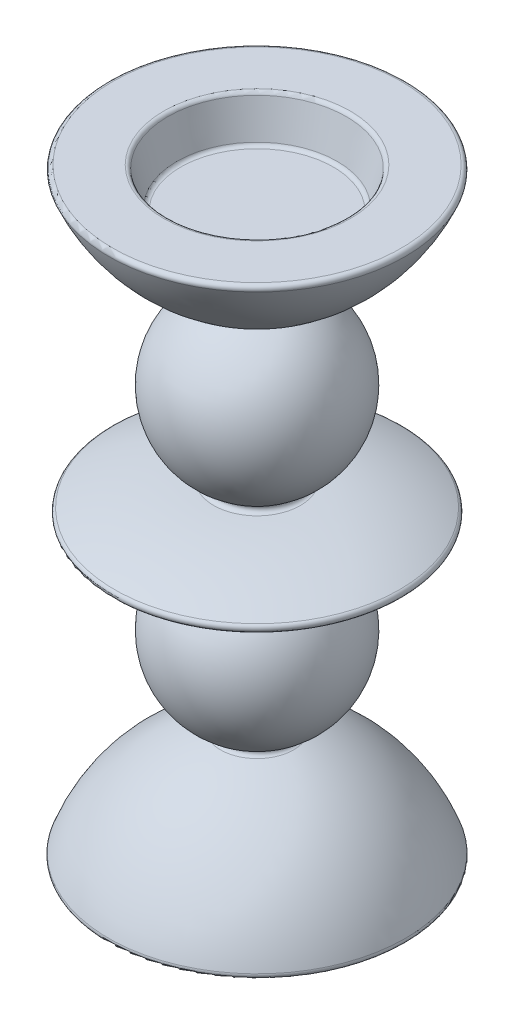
ISO-10303-21;
HEADER;
FILE_DESCRIPTION(('STEP AP214'),'2;1');
FILE_NAME('part.step','',(''),(''),'','','');
FILE_SCHEMA(('AUTOMOTIVE_DESIGN { 1 0 10303 214 1 1 1 1 }'));
ENDSEC;
DATA;
#1=APPLICATION_CONTEXT('core data for automotive mechanical design processes');
#2=APPLICATION_PROTOCOL_DEFINITION('international standard','automotive_design',2000,#1);
#3=PRODUCT_CONTEXT('',#1,'mechanical');
#4=PRODUCT('Part','Part','',(#3));
#5=PRODUCT_RELATED_PRODUCT_CATEGORY('part','',(#4));
#6=PRODUCT_DEFINITION_FORMATION('','',#4);
#7=PRODUCT_DEFINITION_CONTEXT('part definition',#1,'design');
#8=PRODUCT_DEFINITION('design','',#6,#7);
#9=PRODUCT_DEFINITION_SHAPE('','',#8);
#10=(LENGTH_UNIT() NAMED_UNIT(*) SI_UNIT(.MILLI.,.METRE.));
#11=(NAMED_UNIT(*) PLANE_ANGLE_UNIT() SI_UNIT($,.RADIAN.));
#12=(NAMED_UNIT(*) SI_UNIT($,.STERADIAN.) SOLID_ANGLE_UNIT());
#13=UNCERTAINTY_MEASURE_WITH_UNIT(LENGTH_MEASURE(1.E-05),#10,'distance_accuracy_value','');
#14=(GEOMETRIC_REPRESENTATION_CONTEXT(3) GLOBAL_UNCERTAINTY_ASSIGNED_CONTEXT((#13)) GLOBAL_UNIT_ASSIGNED_CONTEXT((#10,
#11,#12)) REPRESENTATION_CONTEXT('',''));
#15=CARTESIAN_POINT('',(0.,0.,0.));
#16=DIRECTION('',(0.,0.,1.));
#17=DIRECTION('',(1.,0.,0.));
#18=AXIS2_PLACEMENT_3D('',#15,#16,#17);
#19=CARTESIAN_POINT('',(0.,150.,0.));
#20=DIRECTION('',(0.,1.,0.));
#21=DIRECTION('',(-1.,0.,0.));
#22=AXIS2_PLACEMENT_3D('',#19,#20,#21);
#23=PLANE('',#22);
#24=CARTESIAN_POINT('',(0.,150.,0.));
#25=DIRECTION('',(0.,1.,0.));
#26=DIRECTION('',(-1.,0.,0.));
#27=AXIS2_PLACEMENT_3D('',#24,#25,#26);
#28=CIRCLE('',#27,36.0147368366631);
#29=CARTESIAN_POINT('',(-36.0147368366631,150.,0.));
#30=VERTEX_POINT('',#29);
#31=EDGE_CURVE('E62',#30,#30,#28,.T.);
#32=ORIENTED_EDGE('',*,*,#31,.T.);
#33=EDGE_LOOP('',(#32));
#34=FACE_BOUND('',#33,.T.);
#35=CARTESIAN_POINT('',(0.,150.,0.));
#36=DIRECTION('',(0.,1.,0.));
#37=DIRECTION('',(-1.,0.,0.));
#38=AXIS2_PLACEMENT_3D('',#35,#36,#37);
#39=CIRCLE('',#38,23.267326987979);
#40=CARTESIAN_POINT('',(-23.267326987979,150.,0.));
#41=VERTEX_POINT('',#40);
#42=EDGE_CURVE('E65',#41,#41,#39,.F.);
#43=ORIENTED_EDGE('',*,*,#42,.T.);
#44=EDGE_LOOP('',(#43));
#45=FACE_BOUND('',#44,.T.);
#46=ADVANCED_FACE('F30',(#34,#45),#23,.T.);
#47=CARTESIAN_POINT('',(4.81553578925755,23.1036435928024,0.));
#48=DIRECTION('',(0.,-1.,0.));
#49=DIRECTION('',(1.,0.,0.));
#50=AXIS2_PLACEMENT_3D('',#47,#48,#49);
#51=PLANE('',#50);
#52=CARTESIAN_POINT('',(0.,23.1036435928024,0.));
#53=DIRECTION('',(0.,-1.,0.));
#54=DIRECTION('',(1.,0.,0.));
#55=AXIS2_PLACEMENT_3D('',#52,#53,#54);
#56=CIRCLE('',#55,4.81553578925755);
#57=CARTESIAN_POINT('',(4.81553578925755,23.1036435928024,0.));
#58=VERTEX_POINT('',#57);
#59=EDGE_CURVE('E98',#58,#58,#56,.T.);
#60=ORIENTED_EDGE('',*,*,#59,.T.);
#61=EDGE_LOOP('',(#60));
#62=FACE_BOUND('',#61,.T.);
#63=ADVANCED_FACE('F102',(#62),#51,.T.);
#64=CARTESIAN_POINT('',(0.,-13.7910629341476,0.));
#65=DIRECTION('',(0.,-1.,0.));
#66=DIRECTION('',(1.,0.,0.));
#67=AXIS2_PLACEMENT_3D('',#64,#65,#66);
#68=DEGENERATE_TOROIDAL_SURFACE('',#67,4.28285034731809,38.,.F.);
#69=CARTESIAN_POINT('',(0.,0.620741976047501,0.));
#70=DIRECTION('',(0.,-1.,0.));
#71=DIRECTION('',(1.,0.,0.));
#72=AXIS2_PLACEMENT_3D('',#69,#70,#71);
#73=CIRCLE('',#72,30.8782059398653);
#74=CARTESIAN_POINT('',(30.8782059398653,0.620741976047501,0.));
#75=VERTEX_POINT('',#74);
#76=EDGE_CURVE('E95',#75,#75,#73,.T.);
#77=ORIENTED_EDGE('',*,*,#76,.T.);
#78=EDGE_LOOP('',(#77));
#79=FACE_BOUND('',#78,.T.);
#80=ORIENTED_EDGE('',*,*,#59,.F.);
#81=EDGE_LOOP('',(#80));
#82=FACE_BOUND('',#81,.T.);
#83=ADVANCED_FACE('F104',(#79,#82),#68,.T.);
#84=CARTESIAN_POINT('',(37.5,0.,0.));
#85=DIRECTION('',(0.,-1.,0.));
#86=DIRECTION('',(1.,0.,0.));
#87=AXIS2_PLACEMENT_3D('',#84,#85,#86);
#88=PLANE('',#87);
#89=CARTESIAN_POINT('',(0.,0.,0.));
#90=DIRECTION('',(0.,-1.,0.));
#91=DIRECTION('',(1.,0.,0.));
#92=AXIS2_PLACEMENT_3D('',#89,#90,#91);
#93=CIRCLE('',#92,31.8034968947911);
#94=CARTESIAN_POINT('',(31.8034968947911,0.,0.));
#95=VERTEX_POINT('',#94);
#96=EDGE_CURVE('E89',#95,#95,#93,.F.);
#97=ORIENTED_EDGE('',*,*,#96,.T.);
#98=EDGE_LOOP('',(#97));
#99=FACE_BOUND('',#98,.T.);
#100=CARTESIAN_POINT('',(0.,0.,0.));
#101=DIRECTION('',(0.,-1.,0.));
#102=DIRECTION('',(1.,0.,0.));
#103=AXIS2_PLACEMENT_3D('',#100,#101,#102);
#104=CIRCLE('',#103,36.0931878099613);
#105=CARTESIAN_POINT('',(36.0931878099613,0.,0.));
#106=VERTEX_POINT('',#105);
#107=EDGE_CURVE('E92',#106,#106,#104,.T.);
#108=ORIENTED_EDGE('',*,*,#107,.T.);
#109=EDGE_LOOP('',(#108));
#110=FACE_BOUND('',#109,.T.);
#111=ADVANCED_FACE('F106',(#99,#110),#88,.T.);
#112=CARTESIAN_POINT('',(0.,-13.7910629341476,0.));
#113=DIRECTION('',(0.,-1.,0.));
#114=DIRECTION('',(1.,0.,0.));
#115=AXIS2_PLACEMENT_3D('',#112,#113,#114);
#116=DEGENERATE_TOROIDAL_SURFACE('',#115,4.28285034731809,44.,.F.);
#117=CARTESIAN_POINT('',(0.,1.34397820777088,0.));
#118=DIRECTION('',(0.,-1.,0.));
#119=DIRECTION('',(1.,0.,0.));
#120=AXIS2_PLACEMENT_3D('',#117,#118,#119);
#121=CIRCLE('',#120,37.032165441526);
#122=CARTESIAN_POINT('',(37.032165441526,1.34397820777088,0.));
#123=VERTEX_POINT('',#122);
#124=EDGE_CURVE('E83',#123,#123,#121,.F.);
#125=ORIENTED_EDGE('',*,*,#124,.T.);
#126=EDGE_LOOP('',(#125));
#127=FACE_BOUND('',#126,.T.);
#128=CARTESIAN_POINT('',(0.,28.1173566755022,0.));
#129=DIRECTION('',(0.,-1.,0.));
#130=DIRECTION('',(1.,0.,0.));
#131=AXIS2_PLACEMENT_3D('',#128,#129,#130);
#132=CIRCLE('',#131,9.12178936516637);
#133=CARTESIAN_POINT('',(9.12178936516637,28.1173566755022,0.));
#134=VERTEX_POINT('',#133);
#135=EDGE_CURVE('E86',#134,#134,#132,.T.);
#136=ORIENTED_EDGE('',*,*,#135,.T.);
#137=EDGE_LOOP('',(#136));
#138=FACE_BOUND('',#137,.T.);
#139=ADVANCED_FACE('F113',(#127,#138),#116,.F.);
#140=CARTESIAN_POINT('',(0.,49.5,0.));
#141=DIRECTION('',(0.,-1.,0.));
#142=DIRECTION('',(1.,0.,0.));
#143=AXIS2_PLACEMENT_3D('',#140,#141,#142);
#144=SPHERICAL_SURFACE('',#143,21.5);
#145=CARTESIAN_POINT('',(0.,29.9778287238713,0.));
#146=DIRECTION('',(0.,1.,0.));
#147=DIRECTION('',(-1.,0.,0.));
#148=AXIS2_PLACEMENT_3D('',#145,#146,#147);
#149=CIRCLE('',#148,9.00748736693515);
#150=CARTESIAN_POINT('',(9.00748736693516,29.9778287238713,0.));
#151=VERTEX_POINT('',#150);
#152=EDGE_CURVE('E41',#151,#151,#149,.T.);
#153=CARTESIAN_POINT('',(0.,67.7942402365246,0.));
#154=DIRECTION('',(0.,-1.,0.));
#155=DIRECTION('',(1.,0.,0.));
#156=AXIS2_PLACEMENT_3D('',#153,#154,#155);
#157=CIRCLE('',#156,11.2947232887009);
#158=CARTESIAN_POINT('',(11.2947232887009,67.7942402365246,0.));
#159=VERTEX_POINT('',#158);
#160=EDGE_CURVE('E45',#159,#159,#157,.T.);
#161=CARTESIAN_POINT('',(9.00748736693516,29.9778287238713,0.));
#162=CARTESIAN_POINT('',(9.22672523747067,30.078982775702,0.));
#163=CARTESIAN_POINT('',(9.44425766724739,30.1838328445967,0.));
#164=CARTESIAN_POINT('',(9.87566802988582,30.4007995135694,0.));
#165=CARTESIAN_POINT('',(10.0895459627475,30.5129161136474,0.));
#166=CARTESIAN_POINT('',(10.5134037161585,30.7442903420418,0.));
#167=CARTESIAN_POINT('',(10.7233835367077,30.8635479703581,0.));
#168=CARTESIAN_POINT('',(11.1392069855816,31.1090684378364,0.));
#169=CARTESIAN_POINT('',(11.3450506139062,31.2353312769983,0.));
#170=CARTESIAN_POINT('',(11.7523679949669,31.4947189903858,0.));
#171=CARTESIAN_POINT('',(11.953841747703,31.6278438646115,0.));
#172=CARTESIAN_POINT('',(12.3521907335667,31.9008045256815,0.));
#173=CARTESIAN_POINT('',(12.5490659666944,32.0406403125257,0.));
#174=CARTESIAN_POINT('',(12.9379944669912,32.3268641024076,0.));
#175=CARTESIAN_POINT('',(13.1300477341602,32.4732521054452,0.));
#176=CARTESIAN_POINT('',(13.5091143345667,32.772414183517,0.));
#177=CARTESIAN_POINT('',(13.6961276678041,32.9251882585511,0.));
#178=CARTESIAN_POINT('',(14.0649021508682,33.2369490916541,0.));
#179=CARTESIAN_POINT('',(14.2466633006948,33.3959358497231,0.));
#180=CARTESIAN_POINT('',(14.6047271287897,33.7199416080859,0.));
#181=CARTESIAN_POINT('',(14.7810298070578,33.8849606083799,0.));
#182=CARTESIAN_POINT('',(15.1279765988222,34.2208435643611,0.));
#183=CARTESIAN_POINT('',(15.2986207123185,34.3917075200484,0.));
#184=CARTESIAN_POINT('',(15.6340567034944,34.7390864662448,0.));
#185=CARTESIAN_POINT('',(15.798848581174,34.915601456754,0.));
#186=CARTESIAN_POINT('',(16.1223930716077,35.2740821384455,0.));
#187=CARTESIAN_POINT('',(16.2811456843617,35.4560478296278,0.));
#188=CARTESIAN_POINT('',(16.592431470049,35.8252233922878,0.));
#189=CARTESIAN_POINT('',(16.7449646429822,36.0124332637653,0.));
#190=CARTESIAN_POINT('',(17.0436384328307,36.3918847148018,0.));
#191=CARTESIAN_POINT('',(17.189779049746,36.5841262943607,0.));
#192=CARTESIAN_POINT('',(17.4755018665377,36.9734229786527,0.));
#193=CARTESIAN_POINT('',(17.6150840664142,37.1704780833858,0.));
#194=CARTESIAN_POINT('',(17.8875316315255,37.5691781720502,0.));
#195=CARTESIAN_POINT('',(18.0203969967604,37.7708231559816,0.));
#196=CARTESIAN_POINT('',(18.279260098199,38.1784741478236,0.));
#197=CARTESIAN_POINT('',(18.4052578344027,38.3844801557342,0.));
#198=CARTESIAN_POINT('',(18.6502426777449,38.8006193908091,0.));
#199=CARTESIAN_POINT('',(18.7692297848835,39.0107526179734,0.));
#200=CARTESIAN_POINT('',(19.000058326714,39.4349078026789,0.));
#201=CARTESIAN_POINT('',(19.111899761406,39.64892976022,0.));
#202=CARTESIAN_POINT('',(19.3283100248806,40.0806195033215,0.));
#203=CARTESIAN_POINT('',(19.4328788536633,40.2982872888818,0.));
#204=CARTESIAN_POINT('',(19.6346252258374,40.7370216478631,0.));
#205=CARTESIAN_POINT('',(19.7318027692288,40.9580882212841,0.));
#206=CARTESIAN_POINT('',(19.9186562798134,41.4033692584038,0.));
#207=CARTESIAN_POINT('',(20.0083322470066,41.6275837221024,0.));
#208=CARTESIAN_POINT('',(20.1800808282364,42.0789060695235,0.));
#209=CARTESIAN_POINT('',(20.262153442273,42.306013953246,0.));
#210=CARTESIAN_POINT('',(20.4186021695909,42.762865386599,0.));
#211=CARTESIAN_POINT('',(20.4929782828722,42.9926089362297,0.));
#212=CARTESIAN_POINT('',(20.633949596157,43.4544709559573,0.));
#213=CARTESIAN_POINT('',(20.7005447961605,43.6865894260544,0.));
#214=CARTESIAN_POINT('',(20.8258787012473,44.1529378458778,0.));
#215=CARTESIAN_POINT('',(20.8846174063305,44.3871677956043,0.));
#216=CARTESIAN_POINT('',(20.9941716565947,44.857473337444,0.));
#217=CARTESIAN_POINT('',(21.0449872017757,45.0935489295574,0.));
#218=CARTESIAN_POINT('',(21.1386374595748,45.5672778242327,0.));
#219=CARTESIAN_POINT('',(21.1814721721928,45.8049311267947,0.));
#220=CARTESIAN_POINT('',(21.2591121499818,46.2815457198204,0.));
#221=CARTESIAN_POINT('',(21.2939174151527,46.5205070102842,0.));
#222=CARTESIAN_POINT('',(21.3554589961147,46.9994663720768,0.));
#223=CARTESIAN_POINT('',(21.3821953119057,47.2394644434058,0.));
#224=CARTESIAN_POINT('',(21.4275686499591,47.7202249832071,0.));
#225=CARTESIAN_POINT('',(21.4462056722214,47.9609874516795,0.));
#226=CARTESIAN_POINT('',(21.4753592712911,48.4430035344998,0.));
#227=CARTESIAN_POINT('',(21.4858758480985,48.6842571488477,0.));
#228=CARTESIAN_POINT('',(21.4987766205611,49.1669817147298,0.));
#229=CARTESIAN_POINT('',(21.5011608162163,49.4084526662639,0.));
#230=CARTESIAN_POINT('',(21.4977941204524,49.8913378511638,0.));
#231=CARTESIAN_POINT('',(21.4920432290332,50.1327520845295,0.));
#232=CARTESIAN_POINT('',(21.4724128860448,50.6152498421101,0.));
#233=CARTESIAN_POINT('',(21.4585334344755,50.8563333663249,0.));
#234=CARTESIAN_POINT('',(21.4226617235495,51.3378960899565,0.));
#235=CARTESIAN_POINT('',(21.4006694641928,51.5783752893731,0.));
#236=CARTESIAN_POINT('',(21.3485970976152,52.0584564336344,0.));
#237=CARTESIAN_POINT('',(21.3185169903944,52.2980583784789,0.));
#238=CARTESIAN_POINT('',(21.2503030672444,52.7761130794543,0.));
#239=CARTESIAN_POINT('',(21.2121692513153,53.0145658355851,0.));
#240=CARTESIAN_POINT('',(21.1278911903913,53.4900515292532,0.));
#241=CARTESIAN_POINT('',(21.0817469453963,53.7270844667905,0.));
#242=CARTESIAN_POINT('',(20.9815003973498,54.1994615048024,0.));
#243=CARTESIAN_POINT('',(20.9273980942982,54.434805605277,0.));
#244=CARTESIAN_POINT('',(20.8112968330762,54.9035378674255,0.));
#245=CARTESIAN_POINT('',(20.7492978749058,55.1369260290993,0.));
#246=CARTESIAN_POINT('',(20.6174736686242,55.6014815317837,0.));
#247=CARTESIAN_POINT('',(20.5476484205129,55.8326488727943,0.));
#248=CARTESIAN_POINT('',(20.400250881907,56.2925003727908,0.));
#249=CARTESIAN_POINT('',(20.3226785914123,56.5211845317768,0.));
#250=CARTESIAN_POINT('',(20.1598750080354,56.9758101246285,0.));
#251=CARTESIAN_POINT('',(20.0746437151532,57.2017515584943,0.));
#252=CARTESIAN_POINT('',(19.8966188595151,57.6506352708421,0.));
#253=CARTESIAN_POINT('',(19.8038252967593,57.8735775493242,0.));
#254=CARTESIAN_POINT('',(19.6107812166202,58.3162099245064,0.));
#255=CARTESIAN_POINT('',(19.510530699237,58.5359000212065,0.));
#256=CARTESIAN_POINT('',(19.3026864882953,58.9717786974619,0.));
#257=CARTESIAN_POINT('',(19.1950927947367,59.1879672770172,0.));
#258=CARTESIAN_POINT('',(18.9726843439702,59.6165975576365,0.));
#259=CARTESIAN_POINT('',(18.8578695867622,59.8290392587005,0.));
#260=CARTESIAN_POINT('',(18.6211493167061,60.249934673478,0.));
#261=CARTESIAN_POINT('',(18.499243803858,60.4583883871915,0.));
#262=CARTESIAN_POINT('',(18.248480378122,60.8710712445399,0.));
#263=CARTESIAN_POINT('',(18.1196224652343,61.075300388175,0.));
#264=CARTESIAN_POINT('',(17.8551004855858,61.4793023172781,0.));
#265=CARTESIAN_POINT('',(17.7194364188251,61.6790751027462,0.));
#266=CARTESIAN_POINT('',(17.4414561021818,62.0739375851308,0.));
#267=CARTESIAN_POINT('',(17.2991398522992,62.2690272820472,0.));
#268=CARTESIAN_POINT('',(17.0080166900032,62.6543021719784,0.));
#269=CARTESIAN_POINT('',(16.8592097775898,62.8444873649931,0.));
#270=CARTESIAN_POINT('',(16.5552741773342,63.2197373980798,0.));
#271=CARTESIAN_POINT('',(16.4001454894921,63.4048022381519,0.));
#272=CARTESIAN_POINT('',(16.0837424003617,63.7696015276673,0.));
#273=CARTESIAN_POINT('',(15.9224679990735,63.9493359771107,0.));
#274=CARTESIAN_POINT('',(15.5939565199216,64.3032704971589,0.));
#275=CARTESIAN_POINT('',(15.426719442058,64.4774705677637,0.));
#276=CARTESIAN_POINT('',(15.0864724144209,64.8201386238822,0.));
#277=CARTESIAN_POINT('',(14.9134624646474,64.9886066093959,0.));
#278=CARTESIAN_POINT('',(14.561866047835,65.3196192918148,0.));
#279=CARTESIAN_POINT('',(14.3832795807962,65.48216398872,0.));
#280=CARTESIAN_POINT('',(14.0207328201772,65.8011456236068,0.));
#281=CARTESIAN_POINT('',(13.8367725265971,65.9575825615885,0.));
#282=CARTESIAN_POINT('',(13.4636868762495,66.264171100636,0.));
#283=CARTESIAN_POINT('',(13.2745615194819,66.4143227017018,0.));
#284=CARTESIAN_POINT('',(12.8913604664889,66.7081702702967,0.));
#285=CARTESIAN_POINT('',(12.6972847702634,66.8518662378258,0.));
#286=CARTESIAN_POINT('',(12.304403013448,67.1326390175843,0.));
#287=CARTESIAN_POINT('',(12.1055969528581,67.2697158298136,0.));
#288=CARTESIAN_POINT('',(11.7034811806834,67.5370963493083,0.));
#289=CARTESIAN_POINT('',(11.5001714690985,67.6674000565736,0.));
#290=CARTESIAN_POINT('',(11.2947232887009,67.7942402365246,0.));
#291=B_SPLINE_CURVE_WITH_KNOTS('',3,(#161,#162,#163,#164,#165,#166,#167,#168,#169,#170,#171,
#172,#173,#174,#175,#176,#177,#178,#179,#180,#181,#182,#183,#184,#185,#186,#187,#188,#189,#190,
#191,#192,#193,#194,#195,#196,#197,#198,#199,#200,#201,#202,#203,#204,#205,#206,#207,#208,#209,
#210,#211,#212,#213,#214,#215,#216,#217,#218,#219,#220,#221,#222,#223,#224,#225,#226,#227,#228,
#229,#230,#231,#232,#233,#234,#235,#236,#237,#238,#239,#240,#241,#242,#243,#244,#245,#246,#247,
#248,#249,#250,#251,#252,#253,#254,#255,#256,#257,#258,#259,#260,#261,#262,#263,#264,#265,#266,
#267,#268,#269,#270,#271,#272,#273,#274,#275,#276,#277,#278,#279,#280,#281,#282,#283,#284,#285,
#286,#287,#288,#289,#290),.UNSPECIFIED.,.F.,.F.,(4,2,2,2,2,2,2,2,2,2,2,2,2,2,2,2,2,2,2,2,2,2,2,
2,2,2,2,2,2,2,2,2,2,2,2,2,2,2,2,2,2,2,2,2,2,2,2,2,2,2,2,2,2,2,2,2,2,2,2,2,2,2,2,2,4),(0.,
0.724311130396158,1.44862226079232,2.17293339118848,2.89724452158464,3.62155565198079,
4.34586678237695,5.0701779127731,5.79448904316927,6.51880017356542,7.24311130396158,
7.96742243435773,8.69173356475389,9.41604469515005,10.1403558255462,10.8646669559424,
11.5889780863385,12.3132892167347,13.0376003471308,13.761911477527,14.4862226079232,
15.2105337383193,15.9348448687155,16.6591559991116,17.3834671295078,18.1077782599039,
18.8320893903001,19.5564005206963,20.2807116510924,21.0050227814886,21.7293339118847,
22.4536450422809,23.177956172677,23.9022673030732,24.6265784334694,25.3508895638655,
26.0752006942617,26.7995118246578,27.523822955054,28.2481340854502,28.9724452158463,
29.6967563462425,30.4210674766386,31.1453786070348,31.8696897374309,32.5940008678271,
33.3183119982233,34.0426231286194,34.7669342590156,35.4912453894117,36.2155565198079,
36.9398676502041,37.6641787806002,38.3884899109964,39.1128010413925,39.8371121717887,
40.5614233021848,41.285734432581,42.0100455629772,42.7343566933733,43.4586678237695,
44.1829789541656,44.9072900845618,45.6316012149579,46.3559123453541),.UNSPECIFIED.);
#292=EDGE_CURVE('BSEAM178',#151,#159,#291,.T.);
#293=ORIENTED_EDGE('',*,*,#152,.T.);
#294=ORIENTED_EDGE('',*,*,#160,.T.);
#295=ORIENTED_EDGE('',*,*,#292,.T.);
#296=ORIENTED_EDGE('',*,*,#292,.F.);
#297=EDGE_LOOP('',(#293,#295,#294,#296));
#298=FACE_BOUND('',#297,.T.);
#299=ADVANCED_FACE('F178',(#298),#144,.T.);
#300=CARTESIAN_POINT('',(0.,129.638664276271,0.));
#301=DIRECTION('',(0.,-1.,0.));
#302=DIRECTION('',(1.,0.,0.));
#303=AXIS2_PLACEMENT_3D('',#300,#301,#302);
#304=DEGENERATE_TOROIDAL_SURFACE('',#303,12.7085424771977,60.,.T.);
#305=CARTESIAN_POINT('',(0.,74.1398819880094,0.));
#306=DIRECTION('',(0.,1.,0.));
#307=DIRECTION('',(-1.,0.,0.));
#308=AXIS2_PLACEMENT_3D('',#305,#306,#307);
#309=CIRCLE('',#308,35.5095329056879);
#310=CARTESIAN_POINT('',(-35.5095329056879,74.1398819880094,0.));
#311=VERTEX_POINT('',#310);
#312=EDGE_CURVE('E56',#311,#311,#309,.F.);
#313=ORIENTED_EDGE('',*,*,#312,.T.);
#314=EDGE_LOOP('',(#313));
#315=FACE_BOUND('',#314,.T.);
#316=CARTESIAN_POINT('',(0.,69.6450290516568,0.));
#317=DIRECTION('',(0.,1.,0.));
#318=DIRECTION('',(-1.,0.,0.));
#319=AXIS2_PLACEMENT_3D('',#316,#317,#318);
#320=CIRCLE('',#319,11.8346245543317);
#321=CARTESIAN_POINT('',(-11.8346245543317,69.6450290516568,0.));
#322=VERTEX_POINT('',#321);
#323=EDGE_CURVE('E59',#322,#322,#320,.T.);
#324=ORIENTED_EDGE('',*,*,#323,.T.);
#325=EDGE_LOOP('',(#324));
#326=FACE_BOUND('',#325,.T.);
#327=ADVANCED_FACE('F169',(#315,#326),#304,.T.);
#328=CARTESIAN_POINT('',(0.,21.7987730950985,0.));
#329=DIRECTION('',(0.,-1.,0.));
#330=DIRECTION('',(1.,0.,0.));
#331=AXIS2_PLACEMENT_3D('',#328,#329,#330);
#332=DEGENERATE_TOROIDAL_SURFACE('',#331,9.75780369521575,60.,.T.);
#333=CARTESIAN_POINT('',(0.,75.967676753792,0.));
#334=DIRECTION('',(0.,-1.,0.));
#335=DIRECTION('',(1.,0.,0.));
#336=AXIS2_PLACEMENT_3D('',#333,#334,#335);
#337=CIRCLE('',#336,35.5595454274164);
#338=CARTESIAN_POINT('',(35.5595454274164,75.967676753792,0.));
#339=VERTEX_POINT('',#338);
#340=EDGE_CURVE('E50',#339,#339,#337,.F.);
#341=ORIENTED_EDGE('',*,*,#340,.T.);
#342=EDGE_LOOP('',(#341));
#343=FACE_BOUND('',#342,.T.);
#344=CARTESIAN_POINT('',(0.,81.7891518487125,0.));
#345=DIRECTION('',(0.,-1.,0.));
#346=DIRECTION('',(1.,0.,0.));
#347=AXIS2_PLACEMENT_3D('',#344,#345,#346);
#348=CIRCLE('',#347,10.8322603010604);
#349=CARTESIAN_POINT('',(10.8322603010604,81.7891518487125,0.));
#350=VERTEX_POINT('',#349);
#351=EDGE_CURVE('E53',#350,#350,#348,.T.);
#352=ORIENTED_EDGE('',*,*,#351,.T.);
#353=EDGE_LOOP('',(#352));
#354=FACE_BOUND('',#353,.T.);
#355=ADVANCED_FACE('F166',(#343,#354),#332,.T.);
#356=CARTESIAN_POINT('',(0.,102.5,0.));
#357=DIRECTION('',(0.,-1.,0.));
#358=DIRECTION('',(1.,0.,0.));
#359=AXIS2_PLACEMENT_3D('',#356,#357,#358);
#360=SPHERICAL_SURFACE('',#359,21.5);
#361=CARTESIAN_POINT('',(0.,83.6650363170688,0.));
#362=DIRECTION('',(0.,1.,0.));
#363=DIRECTION('',(-1.,0.,0.));
#364=AXIS2_PLACEMENT_3D('',#361,#362,#363);
#365=CIRCLE('',#364,10.3679382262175);
#366=CARTESIAN_POINT('',(10.3679382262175,83.6650363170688,0.));
#367=VERTEX_POINT('',#366);
#368=EDGE_CURVE('E10',#367,#367,#365,.T.);
#369=CARTESIAN_POINT('',(0.,121.927431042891,0.));
#370=DIRECTION('',(0.,-1.,0.));
#371=DIRECTION('',(1.,0.,0.));
#372=AXIS2_PLACEMENT_3D('',#369,#370,#371);
#373=CIRCLE('',#372,9.21004468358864);
#374=CARTESIAN_POINT('',(9.21004468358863,121.927431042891,0.));
#375=VERTEX_POINT('',#374);
#376=EDGE_CURVE('E37',#375,#375,#373,.T.);
#377=CARTESIAN_POINT('',(10.3679382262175,83.6650363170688,0.));
#378=CARTESIAN_POINT('',(10.5833347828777,83.7836019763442,0.));
#379=CARTESIAN_POINT('',(10.796695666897,83.9058655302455,0.));
#380=CARTESIAN_POINT('',(11.2190989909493,84.1576378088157,0.));
#381=CARTESIAN_POINT('',(11.4281414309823,84.2871465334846,0.));
#382=CARTESIAN_POINT('',(11.8416607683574,84.5532585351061,0.));
#383=CARTESIAN_POINT('',(12.0461376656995,84.6898618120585,0.));
#384=CARTESIAN_POINT('',(12.4502855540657,84.9700016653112,0.));
#385=CARTESIAN_POINT('',(12.6499565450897,85.1135382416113,0.));
#386=CARTESIAN_POINT('',(13.0442575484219,85.4073758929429,0.));
#387=CARTESIAN_POINT('',(13.2388875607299,85.5576769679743,0.));
#388=CARTESIAN_POINT('',(13.6228775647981,85.8648666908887,0.));
#389=CARTESIAN_POINT('',(13.8122375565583,86.0217553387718,0.));
#390=CARTESIAN_POINT('',(14.185464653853,86.3419355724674,0.));
#391=CARTESIAN_POINT('',(14.3693317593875,86.5052271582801,0.));
#392=CARTESIAN_POINT('',(14.7313566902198,86.8380210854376,0.));
#393=CARTESIAN_POINT('',(14.9095145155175,87.0075234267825,0.));
#394=CARTESIAN_POINT('',(15.2599112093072,87.3525393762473,0.));
#395=CARTESIAN_POINT('',(15.4321500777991,87.5280529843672,0.));
#396=CARTESIAN_POINT('',(15.7705061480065,87.884884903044,0.));
#397=CARTESIAN_POINT('',(15.9366233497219,88.0662032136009,0.));
#398=CARTESIAN_POINT('',(16.2625405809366,88.4344311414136,0.));
#399=CARTESIAN_POINT('',(16.4223406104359,88.6213407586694,0.));
#400=CARTESIAN_POINT('',(16.7354354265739,89.0005313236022,0.));
#401=CARTESIAN_POINT('',(16.8887302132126,89.1928122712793,0.));
#402=CARTESIAN_POINT('',(17.1886341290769,89.5825191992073,0.));
#403=CARTESIAN_POINT('',(17.3352432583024,89.7799451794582,0.));
#404=CARTESIAN_POINT('',(17.6216033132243,90.1797098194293,0.));
#405=CARTESIAN_POINT('',(17.7613542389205,90.3820484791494,0.));
#406=CARTESIAN_POINT('',(18.0338334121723,90.7914003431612,0.));
#407=CARTESIAN_POINT('',(18.1665616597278,90.998413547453,0.));
#408=CARTESIAN_POINT('',(18.4248392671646,91.4168708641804,0.));
#409=CARTESIAN_POINT('',(18.5503886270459,91.628314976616,0.));
#410=CARTESIAN_POINT('',(18.7941606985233,92.0553852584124,0.));
#411=CARTESIAN_POINT('',(18.9123834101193,92.2710114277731,0.));
#412=CARTESIAN_POINT('',(19.1413630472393,92.7061920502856,0.));
#413=CARTESIAN_POINT('',(19.2521199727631,92.9257465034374,0.));
#414=CARTESIAN_POINT('',(19.4660376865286,93.368525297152,0.));
#415=CARTESIAN_POINT('',(19.5691984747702,93.5917496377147,0.));
#416=CARTESIAN_POINT('',(19.7678025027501,94.0416054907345,0.));
#417=CARTESIAN_POINT('',(19.8632457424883,94.2682370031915,0.));
#418=CARTESIAN_POINT('',(20.0463023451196,94.7246404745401,0.));
#419=CARTESIAN_POINT('',(20.1339157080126,94.9544124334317,0.));
#420=CARTESIAN_POINT('',(20.3012094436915,95.416826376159,0.));
#421=CARTESIAN_POINT('',(20.3808898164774,95.6494683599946,0.));
#422=CARTESIAN_POINT('',(20.5322237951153,96.1173485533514,0.));
#423=CARTESIAN_POINT('',(20.6038774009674,96.3525867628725,0.));
#424=CARTESIAN_POINT('',(20.7390735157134,96.825382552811,0.));
#425=CARTESIAN_POINT('',(20.8026160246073,97.0629401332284,0.));
#426=CARTESIAN_POINT('',(20.9215151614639,97.5400950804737,0.));
#427=CARTESIAN_POINT('',(20.9768717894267,97.7796924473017,0.));
#428=CARTESIAN_POINT('',(21.0793340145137,98.2606449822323,0.));
#429=CARTESIAN_POINT('',(21.1264396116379,98.502000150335,0.));
#430=CARTESIAN_POINT('',(21.2123443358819,98.9861842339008,0.));
#431=CARTESIAN_POINT('',(21.2511434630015,99.2290131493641,0.));
#432=CARTESIAN_POINT('',(21.3203895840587,99.7158589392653,0.));
#433=CARTESIAN_POINT('',(21.3508365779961,99.9598758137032,0.));
#434=CARTESIAN_POINT('',(21.403342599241,100.448810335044,0.));
#435=CARTESIAN_POINT('',(21.4254016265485,100.693727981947,0.));
#436=CARTESIAN_POINT('',(21.4611057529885,101.184175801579,0.));
#437=CARTESIAN_POINT('',(21.474750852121,101.429705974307,0.));
#438=CARTESIAN_POINT('',(21.4936110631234,101.921089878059,0.));
#439=CARTESIAN_POINT('',(21.4988261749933,102.166943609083,0.));
#440=CARTESIAN_POINT('',(21.50082027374,102.658685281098,0.));
#441=CARTESIAN_POINT('',(21.4975992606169,102.904573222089,0.));
#442=CARTESIAN_POINT('',(21.4827249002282,103.396093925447,0.));
#443=CARTESIAN_POINT('',(21.4710715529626,103.641726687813,0.));
#444=CARTESIAN_POINT('',(21.4393462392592,104.132447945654,0.));
#445=CARTESIAN_POINT('',(21.4192742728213,104.377536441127,0.));
#446=CARTESIAN_POINT('',(21.3707353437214,104.866880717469,0.));
#447=CARTESIAN_POINT('',(21.3422683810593,105.111136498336,0.));
#448=CARTESIAN_POINT('',(21.2769729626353,105.598527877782,0.));
#449=CARTESIAN_POINT('',(21.2401445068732,105.841663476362,0.));
#450=CARTESIAN_POINT('',(21.1581694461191,106.326528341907,0.));
#451=CARTESIAN_POINT('',(21.113022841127,106.568257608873,0.));
#452=CARTESIAN_POINT('',(21.0144646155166,107.050025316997,0.));
#453=CARTESIAN_POINT('',(20.9610529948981,107.290063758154,0.));
#454=CARTESIAN_POINT('',(20.8460275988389,107.768167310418,0.));
#455=CARTESIAN_POINT('',(20.7844138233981,108.006232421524,0.));
#456=CARTESIAN_POINT('',(20.6530566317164,108.480109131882,0.));
#457=CARTESIAN_POINT('',(20.5833132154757,108.715920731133,0.));
#458=CARTESIAN_POINT('',(20.4357788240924,109.185012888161,0.));
#459=CARTESIAN_POINT('',(20.35798784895,109.418293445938,0.));
#460=CARTESIAN_POINT('',(20.1944498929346,109.882048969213,0.));
#461=CARTESIAN_POINT('',(20.1087029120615,110.112523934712,0.));
#462=CARTESIAN_POINT('',(19.9293538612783,110.570397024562,0.));
#463=CARTESIAN_POINT('',(19.8357517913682,110.797795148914,0.));
#464=CARTESIAN_POINT('',(19.6408027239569,111.249246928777,0.));
#465=CARTESIAN_POINT('',(19.5394557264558,111.473300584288,0.));
#466=CARTESIAN_POINT('',(19.3291360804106,111.917799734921,0.));
#467=CARTESIAN_POINT('',(19.2201634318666,112.138245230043,0.));
#468=CARTESIAN_POINT('',(18.9947207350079,112.575268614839,0.));
#469=CARTESIAN_POINT('',(18.8782506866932,112.791846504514,0.));
#470=CARTESIAN_POINT('',(18.6379502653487,113.22087978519,0.));
#471=CARTESIAN_POINT('',(18.514119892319,113.433335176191,0.));
#472=CARTESIAN_POINT('',(18.2592445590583,113.853873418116,0.));
#473=CARTESIAN_POINT('',(18.1281995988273,114.06195626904,0.));
#474=CARTESIAN_POINT('',(17.8590493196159,114.4735045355,0.));
#475=CARTESIAN_POINT('',(17.7209440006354,114.676969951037,0.));
#476=CARTESIAN_POINT('',(17.4378355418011,115.079043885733,0.));
#477=CARTESIAN_POINT('',(17.2928324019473,115.277652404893,0.));
#478=CARTESIAN_POINT('',(16.996098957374,115.669778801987,0.));
#479=CARTESIAN_POINT('',(16.8443686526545,115.86329667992,0.));
#480=CARTESIAN_POINT('',(16.5343594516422,116.245014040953,0.));
#481=CARTESIAN_POINT('',(16.3760805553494,116.433213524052,0.));
#482=CARTESIAN_POINT('',(16.0531604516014,116.804072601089,0.));
#483=CARTESIAN_POINT('',(15.8885192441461,116.986732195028,0.));
#484=CARTESIAN_POINT('',(15.5530682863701,117.34629651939,0.));
#485=CARTESIAN_POINT('',(15.3822585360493,117.523201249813,0.));
#486=CARTESIAN_POINT('',(15.0346715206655,117.871047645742,0.));
#487=CARTESIAN_POINT('',(14.8578942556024,118.041989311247,0.));
#488=CARTESIAN_POINT('',(14.4985802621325,118.377708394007,0.));
#489=CARTESIAN_POINT('',(14.3160435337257,118.542485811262,0.));
#490=CARTESIAN_POINT('',(13.94542544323,118.865682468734,0.));
#491=CARTESIAN_POINT('',(13.7573440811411,119.024101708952,0.));
#492=CARTESIAN_POINT('',(13.3758580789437,119.334395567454,0.));
#493=CARTESIAN_POINT('',(13.1824534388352,119.48627018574,0.));
#494=CARTESIAN_POINT('',(12.7905484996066,119.783296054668,0.));
#495=CARTESIAN_POINT('',(12.5920482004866,119.928447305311,0.));
#496=CARTESIAN_POINT('',(12.1901855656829,120.21185561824,0.));
#497=CARTESIAN_POINT('',(11.9868232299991,120.350112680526,0.));
#498=CARTESIAN_POINT('',(11.5754758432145,120.619569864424,0.));
#499=CARTESIAN_POINT('',(11.3674907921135,120.750769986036,0.));
#500=CARTESIAN_POINT('',(10.9471428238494,121.005959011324,0.));
#501=CARTESIAN_POINT('',(10.7347799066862,121.129947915,0.));
#502=CARTESIAN_POINT('',(10.3059258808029,121.370568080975,0.));
#503=CARTESIAN_POINT('',(10.0894347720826,121.487199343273,0.));
#504=CARTESIAN_POINT('',(9.65258011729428,121.712968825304,0.));
#505=CARTESIAN_POINT('',(9.43221657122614,121.822107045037,0.));
#506=CARTESIAN_POINT('',(9.21004468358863,121.927431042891,0.));
#507=B_SPLINE_CURVE_WITH_KNOTS('',3,(#377,#378,#379,#380,#381,#382,#383,#384,#385,#386,#387,
#388,#389,#390,#391,#392,#393,#394,#395,#396,#397,#398,#399,#400,#401,#402,#403,#404,#405,#406,
#407,#408,#409,#410,#411,#412,#413,#414,#415,#416,#417,#418,#419,#420,#421,#422,#423,#424,#425,
#426,#427,#428,#429,#430,#431,#432,#433,#434,#435,#436,#437,#438,#439,#440,#441,#442,#443,#444,
#445,#446,#447,#448,#449,#450,#451,#452,#453,#454,#455,#456,#457,#458,#459,#460,#461,#462,#463,
#464,#465,#466,#467,#468,#469,#470,#471,#472,#473,#474,#475,#476,#477,#478,#479,#480,#481,#482,
#483,#484,#485,#486,#487,#488,#489,#490,#491,#492,#493,#494,#495,#496,#497,#498,#499,#500,#501,
#502,#503,#504,#505,#506),.UNSPECIFIED.,.F.,.F.,(4,2,2,2,2,2,2,2,2,2,2,2,2,2,2,2,2,2,2,2,2,2,2,
2,2,2,2,2,2,2,2,2,2,2,2,2,2,2,2,2,2,2,2,2,2,2,2,2,2,2,2,2,2,2,2,2,2,2,2,2,2,2,2,2,4),(0.,
0.737582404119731,1.47516480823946,2.21274721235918,2.95032961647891,3.68791202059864,
4.42549442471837,5.1630768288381,5.90065923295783,6.63824163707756,7.37582404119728,
8.11340644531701,8.85098884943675,9.58857125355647,10.3261536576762,11.0637360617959,
11.8013184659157,12.5389008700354,13.2764832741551,14.0140656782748,14.7516480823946,
15.4892304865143,16.226812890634,16.9643952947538,17.7019776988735,18.4395601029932,
19.177142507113,19.9147249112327,20.6523073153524,21.3898897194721,22.1274721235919,
22.8650545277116,23.6026369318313,24.3402193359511,25.0778017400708,25.8153841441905,
26.5529665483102,27.29054895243,28.0281313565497,28.7657137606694,29.5032961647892,
30.2408785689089,30.9784609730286,31.7160433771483,32.4536257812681,33.1912081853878,
33.9287905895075,34.6663729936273,35.403955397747,36.1415378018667,36.8791202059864,
37.6167026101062,38.3542850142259,39.0918674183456,39.8294498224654,40.5670322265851,
41.3046146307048,42.0421970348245,42.7797794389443,43.517361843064,44.2549442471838,
44.9925266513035,45.7301090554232,46.4676914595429,47.2052738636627),.UNSPECIFIED.);
#508=EDGE_CURVE('BSEAM168',#367,#375,#507,.T.);
#509=ORIENTED_EDGE('',*,*,#368,.T.);
#510=ORIENTED_EDGE('',*,*,#376,.T.);
#511=ORIENTED_EDGE('',*,*,#508,.T.);
#512=ORIENTED_EDGE('',*,*,#508,.F.);
#513=EDGE_LOOP('',(#509,#511,#510,#512));
#514=FACE_BOUND('',#513,.T.);
#515=ADVANCED_FACE('F168',(#514),#360,.T.);
#516=CARTESIAN_POINT('',(0.,165.857097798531,0.));
#517=DIRECTION('',(0.,-1.,0.));
#518=DIRECTION('',(1.,0.,0.));
#519=AXIS2_PLACEMENT_3D('',#516,#517,#518);
#520=DEGENERATE_TOROIDAL_SURFACE('',#519,3.54329968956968,44.,.F.);
#521=CARTESIAN_POINT('',(0.,148.607974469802,0.));
#522=DIRECTION('',(0.,1.,0.));
#523=DIRECTION('',(-1.,0.,0.));
#524=AXIS2_PLACEMENT_3D('',#521,#522,#523);
#525=CIRCLE('',#524,36.9346911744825);
#526=CARTESIAN_POINT('',(-36.9346911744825,148.607974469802,0.));
#527=VERTEX_POINT('',#526);
#528=EDGE_CURVE('E68',#527,#527,#525,.F.);
#529=ORIENTED_EDGE('',*,*,#528,.T.);
#530=EDGE_LOOP('',(#529));
#531=FACE_BOUND('',#530,.T.);
#532=CARTESIAN_POINT('',(0.,123.787167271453,0.));
#533=DIRECTION('',(0.,1.,0.));
#534=DIRECTION('',(-1.,0.,0.));
#535=AXIS2_PLACEMENT_3D('',#532,#533,#534);
#536=CIRCLE('',#535,9.34549177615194);
#537=CARTESIAN_POINT('',(-9.34549177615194,123.787167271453,0.));
#538=VERTEX_POINT('',#537);
#539=EDGE_CURVE('E71',#538,#538,#536,.T.);
#540=ORIENTED_EDGE('',*,*,#539,.T.);
#541=EDGE_LOOP('',(#540));
#542=FACE_BOUND('',#541,.T.);
#543=ADVANCED_FACE('F176',(#531,#542),#520,.F.);
#544=CARTESIAN_POINT('',(0.,150.,0.));
#545=DIRECTION('',(0.,1.,0.));
#546=DIRECTION('',(0.,0.,1.));
#547=AXIS2_PLACEMENT_3D('',#544,#545,#546);
#548=CONICAL_SURFACE('',#547,22.5,0.26179938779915);
#549=CARTESIAN_POINT('',(0.,140.741180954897,0.));
#550=DIRECTION('',(0.,-1.,0.));
#551=DIRECTION('',(0.,0.,-1.));
#552=AXIS2_PLACEMENT_3D('',#549,#550,#551);
#553=CIRCLE('',#552,20.0191069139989);
#554=CARTESIAN_POINT('',(0.,140.741180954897,-20.0191069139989));
#555=VERTEX_POINT('',#554);
#556=EDGE_CURVE('E74',#555,#555,#553,.T.);
#557=ORIENTED_EDGE('',*,*,#556,.T.);
#558=EDGE_LOOP('',(#557));
#559=FACE_BOUND('',#558,.T.);
#560=CARTESIAN_POINT('',(0.,149.258819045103,0.));
#561=DIRECTION('',(0.,1.,0.));
#562=DIRECTION('',(0.,0.,1.));
#563=AXIS2_PLACEMENT_3D('',#560,#561,#562);
#564=CIRCLE('',#563,22.3014011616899);
#565=CARTESIAN_POINT('',(0.,149.258819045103,22.3014011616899));
#566=VERTEX_POINT('',#565);
#567=EDGE_CURVE('E77',#566,#566,#564,.T.);
#568=ORIENTED_EDGE('',*,*,#567,.T.);
#569=EDGE_LOOP('',(#568));
#570=FACE_BOUND('',#569,.T.);
#571=ADVANCED_FACE('F226',(#559,#570),#548,.F.);
#572=CARTESIAN_POINT('',(0.,140.,0.));
#573=DIRECTION('',(0.,1.,0.));
#574=DIRECTION('',(0.,0.,1.));
#575=AXIS2_PLACEMENT_3D('',#572,#573,#574);
#576=PLANE('',#575);
#577=CARTESIAN_POINT('',(0.,140.,0.));
#578=DIRECTION('',(0.,1.,0.));
#579=DIRECTION('',(0.,0.,1.));
#580=AXIS2_PLACEMENT_3D('',#577,#578,#579);
#581=CIRCLE('',#580,19.0531810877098);
#582=CARTESIAN_POINT('',(0.,140.,19.0531810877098));
#583=VERTEX_POINT('',#582);
#584=EDGE_CURVE('E80',#583,#583,#581,.T.);
#585=ORIENTED_EDGE('',*,*,#584,.T.);
#586=EDGE_LOOP('',(#585));
#587=FACE_BOUND('',#586,.T.);
#588=ADVANCED_FACE('F128',(#587),#576,.T.);
#589=CARTESIAN_POINT('',(0.,1.,0.));
#590=DIRECTION('',(0.,-1.,0.));
#591=DIRECTION('',(1.,0.,0.));
#592=AXIS2_PLACEMENT_3D('',#589,#590,#591);
#593=TOROIDAL_SURFACE('',#592,31.8034968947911,1.);
#594=ORIENTED_EDGE('',*,*,#96,.F.);
#595=EDGE_LOOP('',(#594));
#596=FACE_BOUND('',#595,.T.);
#597=ORIENTED_EDGE('',*,*,#76,.F.);
#598=EDGE_LOOP('',(#597));
#599=FACE_BOUND('',#598,.T.);
#600=ADVANCED_FACE('F124',(#596,#599),#593,.T.);
#601=CARTESIAN_POINT('',(0.,1.,0.));
#602=DIRECTION('',(0.,-1.,0.));
#603=DIRECTION('',(1.,0.,0.));
#604=AXIS2_PLACEMENT_3D('',#601,#602,#603);
#605=TOROIDAL_SURFACE('',#604,36.0931878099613,1.);
#606=ORIENTED_EDGE('',*,*,#124,.F.);
#607=EDGE_LOOP('',(#606));
#608=FACE_BOUND('',#607,.T.);
#609=ORIENTED_EDGE('',*,*,#107,.F.);
#610=EDGE_LOOP('',(#609));
#611=FACE_BOUND('',#610,.T.);
#612=ADVANCED_FACE('F127',(#608,#611),#605,.T.);
#613=CARTESIAN_POINT('',(0.,141.,0.));
#614=DIRECTION('',(0.,1.,0.));
#615=DIRECTION('',(0.,0.,1.));
#616=AXIS2_PLACEMENT_3D('',#613,#614,#615);
#617=TOROIDAL_SURFACE('',#616,19.0531810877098,1.);
#618=ORIENTED_EDGE('',*,*,#556,.F.);
#619=EDGE_LOOP('',(#618));
#620=FACE_BOUND('',#619,.T.);
#621=ORIENTED_EDGE('',*,*,#584,.F.);
#622=EDGE_LOOP('',(#621));
#623=FACE_BOUND('',#622,.T.);
#624=ADVANCED_FACE('F132',(#620,#623),#617,.F.);
#625=CARTESIAN_POINT('',(0.,149.,0.));
#626=DIRECTION('',(0.,1.,0.));
#627=DIRECTION('',(-1.,0.,0.));
#628=AXIS2_PLACEMENT_3D('',#625,#626,#627);
#629=TOROIDAL_SURFACE('',#628,36.0147368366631,1.);
#630=ORIENTED_EDGE('',*,*,#31,.F.);
#631=EDGE_LOOP('',(#630));
#632=FACE_BOUND('',#631,.T.);
#633=ORIENTED_EDGE('',*,*,#528,.F.);
#634=EDGE_LOOP('',(#633));
#635=FACE_BOUND('',#634,.T.);
#636=ADVANCED_FACE('F136',(#632,#635),#629,.T.);
#637=CARTESIAN_POINT('',(0.,149.,0.));
#638=DIRECTION('',(0.,1.,0.));
#639=DIRECTION('',(-1.,0.,0.));
#640=AXIS2_PLACEMENT_3D('',#637,#638,#639);
#641=TOROIDAL_SURFACE('',#640,23.267326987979,1.);
#642=ORIENTED_EDGE('',*,*,#42,.F.);
#643=EDGE_LOOP('',(#642));
#644=FACE_BOUND('',#643,.T.);
#645=ORIENTED_EDGE('',*,*,#567,.F.);
#646=EDGE_LOOP('',(#645));
#647=FACE_BOUND('',#646,.T.);
#648=ADVANCED_FACE('F140',(#644,#647),#641,.T.);
#649=CARTESIAN_POINT('',(0.,75.0648616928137,0.));
#650=DIRECTION('',(0.,1.,0.));
#651=DIRECTION('',(-1.,0.,0.));
#652=AXIS2_PLACEMENT_3D('',#649,#650,#651);
#653=TOROIDAL_SURFACE('',#652,35.1295163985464,1.);
#654=ORIENTED_EDGE('',*,*,#340,.F.);
#655=EDGE_LOOP('',(#654));
#656=FACE_BOUND('',#655,.T.);
#657=ORIENTED_EDGE('',*,*,#312,.F.);
#658=EDGE_LOOP('',(#657));
#659=FACE_BOUND('',#658,.T.);
#660=ADVANCED_FACE('F144',(#656,#659),#653,.T.);
#661=CARTESIAN_POINT('',(0.,29.0698207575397,0.));
#662=DIRECTION('',(0.,1.,0.));
#663=DIRECTION('',(-1.,0.,0.));
#664=AXIS2_PLACEMENT_3D('',#661,#662,#663);
#665=TOROIDAL_SURFACE('',#664,9.42644026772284,1.);
#666=ORIENTED_EDGE('',*,*,#152,.F.);
#667=EDGE_LOOP('',(#666));
#668=FACE_BOUND('',#667,.T.);
#669=ORIENTED_EDGE('',*,*,#135,.F.);
#670=EDGE_LOOP('',(#669));
#671=FACE_BOUND('',#670,.T.);
#672=ADVANCED_FACE('F148',(#668,#671),#665,.F.);
#673=CARTESIAN_POINT('',(0.,68.6451351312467,0.));
#674=DIRECTION('',(0.,-1.,0.));
#675=DIRECTION('',(1.,0.,0.));
#676=AXIS2_PLACEMENT_3D('',#673,#674,#675);
#677=TOROIDAL_SURFACE('',#676,11.8200592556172,1.);
#678=ORIENTED_EDGE('',*,*,#323,.F.);
#679=EDGE_LOOP('',(#678));
#680=FACE_BOUND('',#679,.T.);
#681=ORIENTED_EDGE('',*,*,#160,.F.);
#682=EDGE_LOOP('',(#681));
#683=FACE_BOUND('',#682,.T.);
#684=ADVANCED_FACE('F152',(#680,#683),#677,.F.);
#685=CARTESIAN_POINT('',(0.,82.7889914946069,0.));
#686=DIRECTION('',(0.,1.,0.));
#687=DIRECTION('',(-1.,0.,0.));
#688=AXIS2_PLACEMENT_3D('',#685,#686,#687);
#689=TOROIDAL_SURFACE('',#688,10.8501679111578,1.);
#690=ORIENTED_EDGE('',*,*,#368,.F.);
#691=EDGE_LOOP('',(#690));
#692=FACE_BOUND('',#691,.T.);
#693=ORIENTED_EDGE('',*,*,#351,.F.);
#694=EDGE_LOOP('',(#693));
#695=FACE_BOUND('',#694,.T.);
#696=ADVANCED_FACE('F155',(#692,#695),#689,.F.);
#697=CARTESIAN_POINT('',(0.,122.831032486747,0.));
#698=DIRECTION('',(0.,-1.,0.));
#699=DIRECTION('',(1.,0.,0.));
#700=AXIS2_PLACEMENT_3D('',#697,#698,#699);
#701=TOROIDAL_SURFACE('',#700,9.63841885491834,1.);
#702=ORIENTED_EDGE('',*,*,#539,.F.);
#703=EDGE_LOOP('',(#702));
#704=FACE_BOUND('',#703,.T.);
#705=ORIENTED_EDGE('',*,*,#376,.F.);
#706=EDGE_LOOP('',(#705));
#707=FACE_BOUND('',#706,.T.);
#708=ADVANCED_FACE('F32',(#704,#707),#701,.F.);
#709=CLOSED_SHELL('',(#46,#63,#83,#111,#139,#299,#327,#355,#515,#543,#571,#588,#600,#612,#624,
#636,#648,#660,#672,#684,#696,#708));
#710=MANIFOLD_SOLID_BREP('B2',#709);
#711=ADVANCED_BREP_SHAPE_REPRESENTATION('',(#18,#710),#14);
#712=SHAPE_DEFINITION_REPRESENTATION(#9,#711);
ENDSEC;
END-ISO-10303-21;
